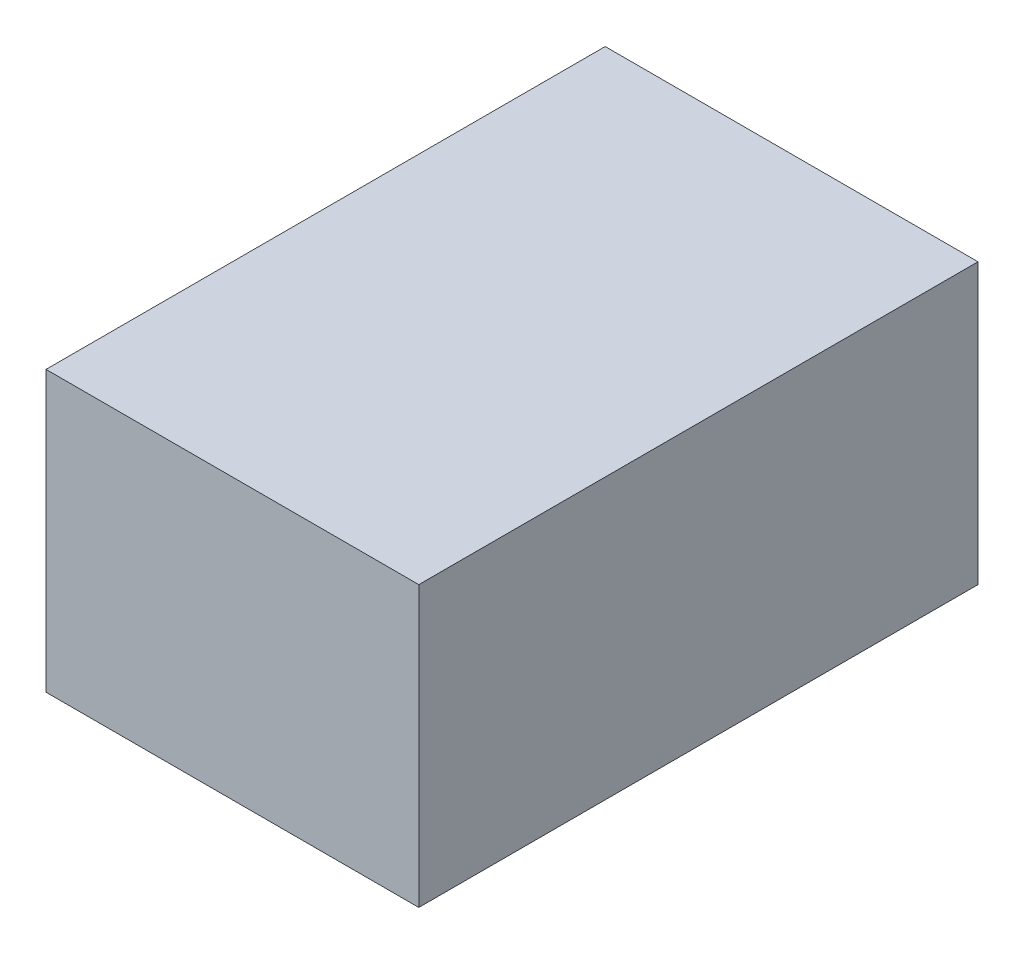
from build123d import *

# Parameters (mm, degrees)
SKETCH_1_W      = 30
SKETCH_1_H      = 15
EXTRUDE_1_DEPTH = 20


with BuildPart() as part:
    # Sketch 1 → Extrude 1 (new body)
    with BuildSketch(Plane(origin=(0, 0, 0), x_dir=(0, 0, -1), z_dir=(1, 0, 0))):
        Rectangle(SKETCH_1_W, SKETCH_1_H)
    extrude(amount=EXTRUDE_1_DEPTH)


solid = part.part
